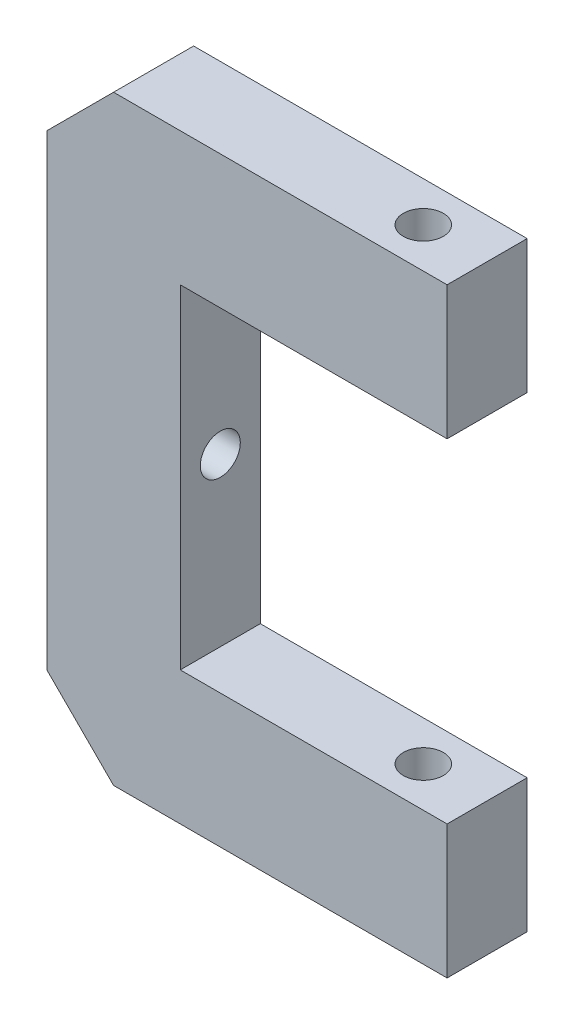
ISO-10303-21;
HEADER;
FILE_DESCRIPTION(('STEP AP214'),'2;1');
FILE_NAME('part.step','',(''),(''),'','','');
FILE_SCHEMA(('AUTOMOTIVE_DESIGN { 1 0 10303 214 1 1 1 1 }'));
ENDSEC;
DATA;
#1=APPLICATION_CONTEXT('core data for automotive mechanical design processes');
#2=APPLICATION_PROTOCOL_DEFINITION('international standard','automotive_design',2000,#1);
#3=PRODUCT_CONTEXT('',#1,'mechanical');
#4=PRODUCT('Part','Part','',(#3));
#5=PRODUCT_RELATED_PRODUCT_CATEGORY('part','',(#4));
#6=PRODUCT_DEFINITION_FORMATION('','',#4);
#7=PRODUCT_DEFINITION_CONTEXT('part definition',#1,'design');
#8=PRODUCT_DEFINITION('design','',#6,#7);
#9=PRODUCT_DEFINITION_SHAPE('','',#8);
#10=(LENGTH_UNIT() NAMED_UNIT(*) SI_UNIT(.MILLI.,.METRE.));
#11=(NAMED_UNIT(*) PLANE_ANGLE_UNIT() SI_UNIT($,.RADIAN.));
#12=(NAMED_UNIT(*) SI_UNIT($,.STERADIAN.) SOLID_ANGLE_UNIT());
#13=UNCERTAINTY_MEASURE_WITH_UNIT(LENGTH_MEASURE(1.E-05),#10,'distance_accuracy_value','');
#14=(GEOMETRIC_REPRESENTATION_CONTEXT(3) GLOBAL_UNCERTAINTY_ASSIGNED_CONTEXT((#13)) GLOBAL_UNIT_ASSIGNED_CONTEXT((#10,
#11,#12)) REPRESENTATION_CONTEXT('',''));
#15=CARTESIAN_POINT('',(0.,0.,0.));
#16=DIRECTION('',(0.,0.,1.));
#17=DIRECTION('',(1.,0.,0.));
#18=AXIS2_PLACEMENT_3D('',#15,#16,#17);
#19=CARTESIAN_POINT('',(0.,45.,6.));
#20=DIRECTION('',(1.,0.,0.));
#21=DIRECTION('',(0.,1.,0.));
#22=AXIS2_PLACEMENT_3D('',#19,#20,#21);
#23=PLANE('',#22);
#24=CARTESIAN_POINT('',(0.,22.5,3.));
#25=DIRECTION('',(-1.,0.,0.));
#26=DIRECTION('',(0.,-1.,0.));
#27=AXIS2_PLACEMENT_3D('',#24,#25,#26);
#28=CIRCLE('',#27,1.5);
#29=CARTESIAN_POINT('',(0.,21.,3.));
#30=VERTEX_POINT('',#29);
#31=EDGE_CURVE('E182',#30,#30,#28,.T.);
#32=ORIENTED_EDGE('',*,*,#31,.F.);
#33=EDGE_LOOP('',(#32));
#34=FACE_BOUND('',#33,.T.);
#35=DIRECTION('',(0.,-1.,0.));
#36=VECTOR('',#35,1.);
#37=CARTESIAN_POINT('',(0.,45.,0.));
#38=LINE('',#37,#36);
#39=CARTESIAN_POINT('',(0.,40.,0.));
#40=VERTEX_POINT('',#39);
#41=CARTESIAN_POINT('',(0.,5.00000000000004,0.));
#42=VERTEX_POINT('',#41);
#43=EDGE_CURVE('E150',#40,#42,#38,.T.);
#44=ORIENTED_EDGE('',*,*,#43,.T.);
#45=DIRECTION('',(0.,0.,1.));
#46=VECTOR('',#45,1.);
#47=CARTESIAN_POINT('',(0.,5.00000000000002,6.));
#48=LINE('',#47,#46);
#49=CARTESIAN_POINT('',(0.,5.00000000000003,6.));
#50=VERTEX_POINT('',#49);
#51=EDGE_CURVE('E54',#42,#50,#48,.T.);
#52=ORIENTED_EDGE('',*,*,#51,.T.);
#53=DIRECTION('',(0.,-1.,0.));
#54=VECTOR('',#53,1.);
#55=CARTESIAN_POINT('',(0.,45.,6.));
#56=LINE('',#55,#54);
#57=CARTESIAN_POINT('',(0.,40.,6.));
#58=VERTEX_POINT('',#57);
#59=EDGE_CURVE('E121',#58,#50,#56,.T.);
#60=ORIENTED_EDGE('',*,*,#59,.F.);
#61=DIRECTION('',(0.,0.,-1.));
#62=VECTOR('',#61,1.);
#63=CARTESIAN_POINT('',(0.,40.,6.));
#64=LINE('',#63,#62);
#65=EDGE_CURVE('E188',#58,#40,#64,.T.);
#66=ORIENTED_EDGE('',*,*,#65,.T.);
#67=EDGE_LOOP('',(#44,#52,#60,#66));
#68=FACE_BOUND('',#67,.T.);
#69=ADVANCED_FACE('F33',(#34,#68),#23,.F.);
#70=CARTESIAN_POINT('',(0.,0.,6.));
#71=DIRECTION('',(0.,1.,0.));
#72=DIRECTION('',(0.,0.,1.));
#73=AXIS2_PLACEMENT_3D('',#70,#71,#72);
#74=PLANE('',#73);
#75=CARTESIAN_POINT('',(25.2169782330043,0.,3.));
#76=DIRECTION('',(0.,1.,0.));
#77=DIRECTION('',(-1.,0.,0.));
#78=AXIS2_PLACEMENT_3D('',#75,#76,#77);
#79=CIRCLE('',#78,1.5);
#80=CARTESIAN_POINT('',(23.7169782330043,0.,3.));
#81=VERTEX_POINT('',#80);
#82=EDGE_CURVE('E271',#81,#81,#79,.T.);
#83=ORIENTED_EDGE('',*,*,#82,.T.);
#84=EDGE_LOOP('',(#83));
#85=FACE_BOUND('',#84,.T.);
#86=DIRECTION('',(1.,0.,0.));
#87=VECTOR('',#86,1.);
#88=CARTESIAN_POINT('',(0.,0.,6.));
#89=LINE('',#88,#87);
#90=CARTESIAN_POINT('',(5.,0.,6.));
#91=VERTEX_POINT('',#90);
#92=CARTESIAN_POINT('',(30.,0.,6.));
#93=VERTEX_POINT('',#92);
#94=EDGE_CURVE('E111',#91,#93,#89,.T.);
#95=ORIENTED_EDGE('',*,*,#94,.F.);
#96=DIRECTION('',(0.,0.,-1.));
#97=VECTOR('',#96,1.);
#98=CARTESIAN_POINT('',(5.,0.,6.));
#99=LINE('',#98,#97);
#100=CARTESIAN_POINT('',(5.,0.,0.));
#101=VERTEX_POINT('',#100);
#102=EDGE_CURVE('E130',#91,#101,#99,.T.);
#103=ORIENTED_EDGE('',*,*,#102,.T.);
#104=DIRECTION('',(1.,0.,0.));
#105=VECTOR('',#104,1.);
#106=CARTESIAN_POINT('',(0.,0.,0.));
#107=LINE('',#106,#105);
#108=CARTESIAN_POINT('',(30.,0.,0.));
#109=VERTEX_POINT('',#108);
#110=EDGE_CURVE('E127',#101,#109,#107,.T.);
#111=ORIENTED_EDGE('',*,*,#110,.T.);
#112=DIRECTION('',(0.,0.,-1.));
#113=VECTOR('',#112,1.);
#114=CARTESIAN_POINT('',(30.,0.,6.));
#115=LINE('',#114,#113);
#116=EDGE_CURVE('E124',#93,#109,#115,.T.);
#117=ORIENTED_EDGE('',*,*,#116,.F.);
#118=EDGE_LOOP('',(#95,#103,#111,#117));
#119=FACE_BOUND('',#118,.T.);
#120=ADVANCED_FACE('F125',(#85,#119),#74,.F.);
#121=CARTESIAN_POINT('',(30.,0.,6.));
#122=DIRECTION('',(-1.,0.,0.));
#123=DIRECTION('',(0.,0.,1.));
#124=AXIS2_PLACEMENT_3D('',#121,#122,#123);
#125=PLANE('',#124);
#126=DIRECTION('',(0.,1.,0.));
#127=VECTOR('',#126,1.);
#128=CARTESIAN_POINT('',(30.,0.,0.));
#129=LINE('',#128,#127);
#130=CARTESIAN_POINT('',(30.,10.,0.));
#131=VERTEX_POINT('',#130);
#132=EDGE_CURVE('E154',#109,#131,#129,.T.);
#133=ORIENTED_EDGE('',*,*,#132,.T.);
#134=DIRECTION('',(0.,0.,-1.));
#135=VECTOR('',#134,1.);
#136=CARTESIAN_POINT('',(30.,10.,6.));
#137=LINE('',#136,#135);
#138=CARTESIAN_POINT('',(30.,10.,6.));
#139=VERTEX_POINT('',#138);
#140=EDGE_CURVE('E131',#139,#131,#137,.T.);
#141=ORIENTED_EDGE('',*,*,#140,.F.);
#142=DIRECTION('',(0.,1.,0.));
#143=VECTOR('',#142,1.);
#144=CARTESIAN_POINT('',(30.,0.,6.));
#145=LINE('',#144,#143);
#146=EDGE_CURVE('E115',#93,#139,#145,.T.);
#147=ORIENTED_EDGE('',*,*,#146,.F.);
#148=ORIENTED_EDGE('',*,*,#116,.T.);
#149=EDGE_LOOP('',(#133,#141,#147,#148));
#150=FACE_BOUND('',#149,.T.);
#151=ADVANCED_FACE('F133',(#150),#125,.F.);
#152=CARTESIAN_POINT('',(30.,10.,6.));
#153=DIRECTION('',(0.,-1.,0.));
#154=DIRECTION('',(1.,0.,0.));
#155=AXIS2_PLACEMENT_3D('',#152,#153,#154);
#156=PLANE('',#155);
#157=CARTESIAN_POINT('',(25.2169782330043,10.,3.));
#158=DIRECTION('',(0.,-1.,0.));
#159=DIRECTION('',(1.,0.,0.));
#160=AXIS2_PLACEMENT_3D('',#157,#158,#159);
#161=CIRCLE('',#160,1.5);
#162=CARTESIAN_POINT('',(23.7169782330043,10.,3.));
#163=VERTEX_POINT('',#162);
#164=EDGE_CURVE('E152',#163,#163,#161,.T.);
#165=ORIENTED_EDGE('',*,*,#164,.T.);
#166=EDGE_LOOP('',(#165));
#167=FACE_BOUND('',#166,.T.);
#168=DIRECTION('',(-1.,0.,0.));
#169=VECTOR('',#168,1.);
#170=CARTESIAN_POINT('',(30.,10.,0.));
#171=LINE('',#170,#169);
#172=CARTESIAN_POINT('',(10.,10.,0.));
#173=VERTEX_POINT('',#172);
#174=EDGE_CURVE('E156',#131,#173,#171,.T.);
#175=ORIENTED_EDGE('',*,*,#174,.T.);
#176=DIRECTION('',(0.,0.,-1.));
#177=VECTOR('',#176,1.);
#178=CARTESIAN_POINT('',(10.,10.,6.));
#179=LINE('',#178,#177);
#180=CARTESIAN_POINT('',(10.,10.,6.));
#181=VERTEX_POINT('',#180);
#182=EDGE_CURVE('E174',#181,#173,#179,.T.);
#183=ORIENTED_EDGE('',*,*,#182,.F.);
#184=DIRECTION('',(-1.,0.,0.));
#185=VECTOR('',#184,1.);
#186=CARTESIAN_POINT('',(30.,10.,6.));
#187=LINE('',#186,#185);
#188=EDGE_CURVE('E136',#139,#181,#187,.T.);
#189=ORIENTED_EDGE('',*,*,#188,.F.);
#190=ORIENTED_EDGE('',*,*,#140,.T.);
#191=EDGE_LOOP('',(#175,#183,#189,#190));
#192=FACE_BOUND('',#191,.T.);
#193=ADVANCED_FACE('F219',(#167,#192),#156,.F.);
#194=CARTESIAN_POINT('',(10.,10.,6.));
#195=DIRECTION('',(-1.,0.,0.));
#196=DIRECTION('',(0.,0.,1.));
#197=AXIS2_PLACEMENT_3D('',#194,#195,#196);
#198=PLANE('',#197);
#199=CARTESIAN_POINT('',(10.,22.5,3.));
#200=DIRECTION('',(-1.,0.,0.));
#201=DIRECTION('',(0.,0.,1.));
#202=AXIS2_PLACEMENT_3D('',#199,#200,#201);
#203=CIRCLE('',#202,1.5);
#204=CARTESIAN_POINT('',(10.,21.,3.));
#205=VERTEX_POINT('',#204);
#206=EDGE_CURVE('E178',#205,#205,#203,.T.);
#207=ORIENTED_EDGE('',*,*,#206,.T.);
#208=EDGE_LOOP('',(#207));
#209=FACE_BOUND('',#208,.T.);
#210=DIRECTION('',(0.,1.,0.));
#211=VECTOR('',#210,1.);
#212=CARTESIAN_POINT('',(10.,10.,0.));
#213=LINE('',#212,#211);
#214=CARTESIAN_POINT('',(10.,35.,0.));
#215=VERTEX_POINT('',#214);
#216=EDGE_CURVE('E158',#173,#215,#213,.T.);
#217=ORIENTED_EDGE('',*,*,#216,.T.);
#218=DIRECTION('',(0.,0.,-1.));
#219=VECTOR('',#218,1.);
#220=CARTESIAN_POINT('',(10.,35.,6.));
#221=LINE('',#220,#219);
#222=CARTESIAN_POINT('',(10.,35.,6.));
#223=VERTEX_POINT('',#222);
#224=EDGE_CURVE('E171',#223,#215,#221,.T.);
#225=ORIENTED_EDGE('',*,*,#224,.F.);
#226=DIRECTION('',(0.,1.,0.));
#227=VECTOR('',#226,1.);
#228=CARTESIAN_POINT('',(10.,10.,6.));
#229=LINE('',#228,#227);
#230=EDGE_CURVE('E138',#181,#223,#229,.T.);
#231=ORIENTED_EDGE('',*,*,#230,.F.);
#232=ORIENTED_EDGE('',*,*,#182,.T.);
#233=EDGE_LOOP('',(#217,#225,#231,#232));
#234=FACE_BOUND('',#233,.T.);
#235=ADVANCED_FACE('F216',(#209,#234),#198,.F.);
#236=CARTESIAN_POINT('',(10.,35.,6.));
#237=DIRECTION('',(0.,1.,0.));
#238=DIRECTION('',(0.,0.,1.));
#239=AXIS2_PLACEMENT_3D('',#236,#237,#238);
#240=PLANE('',#239);
#241=CARTESIAN_POINT('',(25.2169782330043,35.,3.));
#242=DIRECTION('',(0.,1.,0.));
#243=DIRECTION('',(0.,0.,1.));
#244=AXIS2_PLACEMENT_3D('',#241,#242,#243);
#245=CIRCLE('',#244,1.5);
#246=CARTESIAN_POINT('',(23.7169782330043,35.,3.));
#247=VERTEX_POINT('',#246);
#248=EDGE_CURVE('E274',#247,#247,#245,.T.);
#249=ORIENTED_EDGE('',*,*,#248,.T.);
#250=EDGE_LOOP('',(#249));
#251=FACE_BOUND('',#250,.T.);
#252=DIRECTION('',(1.,0.,0.));
#253=VECTOR('',#252,1.);
#254=CARTESIAN_POINT('',(10.,35.,0.));
#255=LINE('',#254,#253);
#256=CARTESIAN_POINT('',(30.,35.,0.));
#257=VERTEX_POINT('',#256);
#258=EDGE_CURVE('E160',#215,#257,#255,.T.);
#259=ORIENTED_EDGE('',*,*,#258,.T.);
#260=DIRECTION('',(0.,0.,-1.));
#261=VECTOR('',#260,1.);
#262=CARTESIAN_POINT('',(30.,35.,6.));
#263=LINE('',#262,#261);
#264=CARTESIAN_POINT('',(30.,35.,6.));
#265=VERTEX_POINT('',#264);
#266=EDGE_CURVE('E168',#265,#257,#263,.T.);
#267=ORIENTED_EDGE('',*,*,#266,.F.);
#268=DIRECTION('',(1.,0.,0.));
#269=VECTOR('',#268,1.);
#270=CARTESIAN_POINT('',(10.,35.,6.));
#271=LINE('',#270,#269);
#272=EDGE_CURVE('E143',#223,#265,#271,.T.);
#273=ORIENTED_EDGE('',*,*,#272,.F.);
#274=ORIENTED_EDGE('',*,*,#224,.T.);
#275=EDGE_LOOP('',(#259,#267,#273,#274));
#276=FACE_BOUND('',#275,.T.);
#277=ADVANCED_FACE('F211',(#251,#276),#240,.F.);
#278=CARTESIAN_POINT('',(30.,35.,6.));
#279=DIRECTION('',(-1.,0.,0.));
#280=DIRECTION('',(0.,0.,1.));
#281=AXIS2_PLACEMENT_3D('',#278,#279,#280);
#282=PLANE('',#281);
#283=DIRECTION('',(0.,1.,0.));
#284=VECTOR('',#283,1.);
#285=CARTESIAN_POINT('',(30.,35.,0.));
#286=LINE('',#285,#284);
#287=CARTESIAN_POINT('',(30.,45.,0.));
#288=VERTEX_POINT('',#287);
#289=EDGE_CURVE('E162',#257,#288,#286,.T.);
#290=ORIENTED_EDGE('',*,*,#289,.T.);
#291=DIRECTION('',(0.,0.,-1.));
#292=VECTOR('',#291,1.);
#293=CARTESIAN_POINT('',(30.,45.,6.));
#294=LINE('',#293,#292);
#295=CARTESIAN_POINT('',(30.,45.,6.));
#296=VERTEX_POINT('',#295);
#297=EDGE_CURVE('E149',#296,#288,#294,.T.);
#298=ORIENTED_EDGE('',*,*,#297,.F.);
#299=DIRECTION('',(0.,1.,0.));
#300=VECTOR('',#299,1.);
#301=CARTESIAN_POINT('',(30.,35.,6.));
#302=LINE('',#301,#300);
#303=EDGE_CURVE('E145',#265,#296,#302,.T.);
#304=ORIENTED_EDGE('',*,*,#303,.F.);
#305=ORIENTED_EDGE('',*,*,#266,.T.);
#306=EDGE_LOOP('',(#290,#298,#304,#305));
#307=FACE_BOUND('',#306,.T.);
#308=ADVANCED_FACE('F205',(#307),#282,.F.);
#309=CARTESIAN_POINT('',(30.,45.,6.));
#310=DIRECTION('',(0.,-1.,0.));
#311=DIRECTION('',(1.,0.,0.));
#312=AXIS2_PLACEMENT_3D('',#309,#310,#311);
#313=PLANE('',#312);
#314=CARTESIAN_POINT('',(25.2169782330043,45.,3.));
#315=DIRECTION('',(0.,1.,0.));
#316=DIRECTION('',(-1.,0.,0.));
#317=AXIS2_PLACEMENT_3D('',#314,#315,#316);
#318=CIRCLE('',#317,1.5);
#319=CARTESIAN_POINT('',(23.7169782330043,45.,3.));
#320=VERTEX_POINT('',#319);
#321=EDGE_CURVE('E181',#320,#320,#318,.T.);
#322=ORIENTED_EDGE('',*,*,#321,.F.);
#323=EDGE_LOOP('',(#322));
#324=FACE_BOUND('',#323,.T.);
#325=DIRECTION('',(-1.,0.,0.));
#326=VECTOR('',#325,1.);
#327=CARTESIAN_POINT('',(30.,45.,0.));
#328=LINE('',#327,#326);
#329=CARTESIAN_POINT('',(5.00000000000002,45.,0.));
#330=VERTEX_POINT('',#329);
#331=EDGE_CURVE('E164',#288,#330,#328,.T.);
#332=ORIENTED_EDGE('',*,*,#331,.T.);
#333=DIRECTION('',(0.,0.,1.));
#334=VECTOR('',#333,1.);
#335=CARTESIAN_POINT('',(5.00000000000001,45.,6.));
#336=LINE('',#335,#334);
#337=CARTESIAN_POINT('',(5.00000000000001,45.,6.));
#338=VERTEX_POINT('',#337);
#339=EDGE_CURVE('E11',#330,#338,#336,.T.);
#340=ORIENTED_EDGE('',*,*,#339,.T.);
#341=DIRECTION('',(-1.,0.,0.));
#342=VECTOR('',#341,1.);
#343=CARTESIAN_POINT('',(30.,45.,6.));
#344=LINE('',#343,#342);
#345=EDGE_CURVE('E147',#296,#338,#344,.T.);
#346=ORIENTED_EDGE('',*,*,#345,.F.);
#347=ORIENTED_EDGE('',*,*,#297,.T.);
#348=EDGE_LOOP('',(#332,#340,#346,#347));
#349=FACE_BOUND('',#348,.T.);
#350=ADVANCED_FACE('F201',(#324,#349),#313,.F.);
#351=CARTESIAN_POINT('',(0.,0.,6.));
#352=DIRECTION('',(0.,0.,1.));
#353=DIRECTION('',(1.,0.,0.));
#354=AXIS2_PLACEMENT_3D('',#351,#352,#353);
#355=PLANE('',#354);
#356=ORIENTED_EDGE('',*,*,#59,.T.);
#357=DIRECTION('',(-0.707106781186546,0.707106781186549,0.));
#358=VECTOR('',#357,1.);
#359=CARTESIAN_POINT('',(2.50000000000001,2.5,6.));
#360=LINE('',#359,#358);
#361=EDGE_CURVE('E41',#50,#91,#360,.F.);
#362=ORIENTED_EDGE('',*,*,#361,.T.);
#363=ORIENTED_EDGE('',*,*,#94,.T.);
#364=ORIENTED_EDGE('',*,*,#146,.T.);
#365=ORIENTED_EDGE('',*,*,#188,.T.);
#366=ORIENTED_EDGE('',*,*,#230,.T.);
#367=ORIENTED_EDGE('',*,*,#272,.T.);
#368=ORIENTED_EDGE('',*,*,#303,.T.);
#369=ORIENTED_EDGE('',*,*,#345,.T.);
#370=DIRECTION('',(0.707106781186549,0.707106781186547,0.));
#371=VECTOR('',#370,1.);
#372=CARTESIAN_POINT('',(-20.,20.0000000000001,6.));
#373=LINE('',#372,#371);
#374=EDGE_CURVE('E192',#338,#58,#373,.F.);
#375=ORIENTED_EDGE('',*,*,#374,.T.);
#376=EDGE_LOOP('',(#356,#362,#363,#364,#365,#366,#367,#368,#369,#375));
#377=FACE_BOUND('',#376,.T.);
#378=ADVANCED_FACE('F113',(#377),#355,.T.);
#379=CARTESIAN_POINT('',(0.,0.,0.));
#380=DIRECTION('',(0.,0.,1.));
#381=DIRECTION('',(1.,0.,0.));
#382=AXIS2_PLACEMENT_3D('',#379,#380,#381);
#383=PLANE('',#382);
#384=ORIENTED_EDGE('',*,*,#110,.F.);
#385=DIRECTION('',(0.707106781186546,-0.707106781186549,0.));
#386=VECTOR('',#385,1.);
#387=CARTESIAN_POINT('',(5.,0.,0.));
#388=LINE('',#387,#386);
#389=EDGE_CURVE('E186',#101,#42,#388,.F.);
#390=ORIENTED_EDGE('',*,*,#389,.T.);
#391=ORIENTED_EDGE('',*,*,#43,.F.);
#392=DIRECTION('',(-0.707106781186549,-0.707106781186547,0.));
#393=VECTOR('',#392,1.);
#394=CARTESIAN_POINT('',(0.,40.,0.));
#395=LINE('',#394,#393);
#396=EDGE_CURVE('E184',#40,#330,#395,.F.);
#397=ORIENTED_EDGE('',*,*,#396,.T.);
#398=ORIENTED_EDGE('',*,*,#331,.F.);
#399=ORIENTED_EDGE('',*,*,#289,.F.);
#400=ORIENTED_EDGE('',*,*,#258,.F.);
#401=ORIENTED_EDGE('',*,*,#216,.F.);
#402=ORIENTED_EDGE('',*,*,#174,.F.);
#403=ORIENTED_EDGE('',*,*,#132,.F.);
#404=EDGE_LOOP('',(#384,#390,#391,#397,#398,#399,#400,#401,#402,#403));
#405=FACE_BOUND('',#404,.T.);
#406=ADVANCED_FACE('F199',(#405),#383,.F.);
#407=CARTESIAN_POINT('',(25.2169782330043,0.,3.));
#408=DIRECTION('',(0.,1.,0.));
#409=DIRECTION('',(-1.,0.,0.));
#410=AXIS2_PLACEMENT_3D('',#407,#408,#409);
#411=CYLINDRICAL_SURFACE('',#410,1.5);
#412=CARTESIAN_POINT('',(23.7169782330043,45.,3.));
#413=CARTESIAN_POINT('',(23.7169782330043,44.8958333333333,3.));
#414=CARTESIAN_POINT('',(23.7169782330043,44.7916666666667,3.));
#415=CARTESIAN_POINT('',(23.7169782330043,44.5833333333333,3.));
#416=CARTESIAN_POINT('',(23.7169782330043,44.4791666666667,3.));
#417=CARTESIAN_POINT('',(23.7169782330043,44.2708333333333,3.));
#418=CARTESIAN_POINT('',(23.7169782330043,44.1666666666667,3.));
#419=CARTESIAN_POINT('',(23.7169782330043,43.9583333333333,3.));
#420=CARTESIAN_POINT('',(23.7169782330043,43.8541666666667,3.));
#421=CARTESIAN_POINT('',(23.7169782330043,43.6458333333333,3.));
#422=CARTESIAN_POINT('',(23.7169782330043,43.5416666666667,3.));
#423=CARTESIAN_POINT('',(23.7169782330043,43.3333333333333,3.));
#424=CARTESIAN_POINT('',(23.7169782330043,43.2291666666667,3.));
#425=CARTESIAN_POINT('',(23.7169782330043,43.0208333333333,3.));
#426=CARTESIAN_POINT('',(23.7169782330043,42.9166666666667,3.));
#427=CARTESIAN_POINT('',(23.7169782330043,42.7083333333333,3.));
#428=CARTESIAN_POINT('',(23.7169782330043,42.6041666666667,3.));
#429=CARTESIAN_POINT('',(23.7169782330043,42.3958333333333,3.));
#430=CARTESIAN_POINT('',(23.7169782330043,42.2916666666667,3.));
#431=CARTESIAN_POINT('',(23.7169782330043,42.0833333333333,3.));
#432=CARTESIAN_POINT('',(23.7169782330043,41.9791666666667,3.));
#433=CARTESIAN_POINT('',(23.7169782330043,41.7708333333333,3.));
#434=CARTESIAN_POINT('',(23.7169782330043,41.6666666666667,3.));
#435=CARTESIAN_POINT('',(23.7169782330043,41.4583333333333,3.));
#436=CARTESIAN_POINT('',(23.7169782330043,41.3541666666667,3.));
#437=CARTESIAN_POINT('',(23.7169782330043,41.1458333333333,3.));
#438=CARTESIAN_POINT('',(23.7169782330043,41.0416666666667,3.));
#439=CARTESIAN_POINT('',(23.7169782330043,40.8333333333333,3.));
#440=CARTESIAN_POINT('',(23.7169782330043,40.7291666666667,3.));
#441=CARTESIAN_POINT('',(23.7169782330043,40.5208333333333,3.));
#442=CARTESIAN_POINT('',(23.7169782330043,40.4166666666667,3.));
#443=CARTESIAN_POINT('',(23.7169782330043,40.2083333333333,3.));
#444=CARTESIAN_POINT('',(23.7169782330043,40.1041666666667,3.));
#445=CARTESIAN_POINT('',(23.7169782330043,39.8958333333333,3.));
#446=CARTESIAN_POINT('',(23.7169782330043,39.7916666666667,3.));
#447=CARTESIAN_POINT('',(23.7169782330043,39.5833333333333,3.));
#448=CARTESIAN_POINT('',(23.7169782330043,39.4791666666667,3.));
#449=CARTESIAN_POINT('',(23.7169782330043,39.2708333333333,3.));
#450=CARTESIAN_POINT('',(23.7169782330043,39.1666666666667,3.));
#451=CARTESIAN_POINT('',(23.7169782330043,38.9583333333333,3.));
#452=CARTESIAN_POINT('',(23.7169782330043,38.8541666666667,3.));
#453=CARTESIAN_POINT('',(23.7169782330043,38.6458333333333,3.));
#454=CARTESIAN_POINT('',(23.7169782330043,38.5416666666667,3.));
#455=CARTESIAN_POINT('',(23.7169782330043,38.3333333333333,3.));
#456=CARTESIAN_POINT('',(23.7169782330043,38.2291666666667,3.));
#457=CARTESIAN_POINT('',(23.7169782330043,38.0208333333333,3.));
#458=CARTESIAN_POINT('',(23.7169782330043,37.9166666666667,3.));
#459=CARTESIAN_POINT('',(23.7169782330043,37.7083333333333,3.));
#460=CARTESIAN_POINT('',(23.7169782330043,37.6041666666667,3.));
#461=CARTESIAN_POINT('',(23.7169782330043,37.3958333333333,3.));
#462=CARTESIAN_POINT('',(23.7169782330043,37.2916666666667,3.));
#463=CARTESIAN_POINT('',(23.7169782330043,37.0833333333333,3.));
#464=CARTESIAN_POINT('',(23.7169782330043,36.9791666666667,3.));
#465=CARTESIAN_POINT('',(23.7169782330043,36.7708333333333,3.));
#466=CARTESIAN_POINT('',(23.7169782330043,36.6666666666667,3.));
#467=CARTESIAN_POINT('',(23.7169782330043,36.4583333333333,3.));
#468=CARTESIAN_POINT('',(23.7169782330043,36.3541666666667,3.));
#469=CARTESIAN_POINT('',(23.7169782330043,36.1458333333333,3.));
#470=CARTESIAN_POINT('',(23.7169782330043,36.0416666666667,3.));
#471=CARTESIAN_POINT('',(23.7169782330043,35.8333333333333,3.));
#472=CARTESIAN_POINT('',(23.7169782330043,35.7291666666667,3.));
#473=CARTESIAN_POINT('',(23.7169782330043,35.5208333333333,3.));
#474=CARTESIAN_POINT('',(23.7169782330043,35.4166666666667,3.));
#475=CARTESIAN_POINT('',(23.7169782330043,35.2083333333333,3.));
#476=CARTESIAN_POINT('',(23.7169782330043,35.1041666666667,3.));
#477=CARTESIAN_POINT('',(23.7169782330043,35.,3.));
#478=B_SPLINE_CURVE_WITH_KNOTS('',3,(#412,#413,#414,#415,#416,#417,#418,#419,#420,#421,#422,
#423,#424,#425,#426,#427,#428,#429,#430,#431,#432,#433,#434,#435,#436,#437,#438,#439,#440,#441,
#442,#443,#444,#445,#446,#447,#448,#449,#450,#451,#452,#453,#454,#455,#456,#457,#458,#459,#460,
#461,#462,#463,#464,#465,#466,#467,#468,#469,#470,#471,#472,#473,#474,#475,#476,#477),
.UNSPECIFIED.,.F.,.F.,(4,2,2,2,2,2,2,2,2,2,2,2,2,2,2,2,2,2,2,2,2,2,2,2,2,2,2,2,2,2,2,2,4),(0.,
0.3125,0.625000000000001,0.937500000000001,1.25,1.5625,1.875,2.1875,2.5,2.8125,3.125,3.4375,
3.75,4.0625,4.375,4.6875,5.,5.3125,5.62500000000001,5.93750000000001,6.25000000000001,
6.56250000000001,6.87500000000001,7.18750000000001,7.50000000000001,7.81250000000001,
8.12500000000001,8.43750000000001,8.75000000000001,9.06250000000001,9.37500000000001,
9.68750000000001,10.),.UNSPECIFIED.);
#479=EDGE_CURVE('BSEAM259',#320,#247,#478,.T.);
#480=ORIENTED_EDGE('',*,*,#321,.T.);
#481=ORIENTED_EDGE('',*,*,#248,.F.);
#482=ORIENTED_EDGE('',*,*,#479,.T.);
#483=ORIENTED_EDGE('',*,*,#479,.F.);
#484=EDGE_LOOP('',(#480,#482,#481,#483));
#485=FACE_BOUND('',#484,.T.);
#486=ADVANCED_FACE('F259',(#485),#411,.F.);
#487=CARTESIAN_POINT('',(23.7169782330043,0.,3.));
#488=CARTESIAN_POINT('',(23.7169782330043,0.104166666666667,3.));
#489=CARTESIAN_POINT('',(23.7169782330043,0.208333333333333,3.));
#490=CARTESIAN_POINT('',(23.7169782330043,0.416666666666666,3.));
#491=CARTESIAN_POINT('',(23.7169782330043,0.520833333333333,3.));
#492=CARTESIAN_POINT('',(23.7169782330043,0.729166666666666,3.));
#493=CARTESIAN_POINT('',(23.7169782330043,0.833333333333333,3.));
#494=CARTESIAN_POINT('',(23.7169782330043,1.04166666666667,3.));
#495=CARTESIAN_POINT('',(23.7169782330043,1.14583333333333,3.));
#496=CARTESIAN_POINT('',(23.7169782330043,1.35416666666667,3.));
#497=CARTESIAN_POINT('',(23.7169782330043,1.45833333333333,3.));
#498=CARTESIAN_POINT('',(23.7169782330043,1.66666666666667,3.));
#499=CARTESIAN_POINT('',(23.7169782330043,1.77083333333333,3.));
#500=CARTESIAN_POINT('',(23.7169782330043,1.97916666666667,3.));
#501=CARTESIAN_POINT('',(23.7169782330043,2.08333333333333,3.));
#502=CARTESIAN_POINT('',(23.7169782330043,2.29166666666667,3.));
#503=CARTESIAN_POINT('',(23.7169782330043,2.39583333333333,3.));
#504=CARTESIAN_POINT('',(23.7169782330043,2.60416666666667,3.));
#505=CARTESIAN_POINT('',(23.7169782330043,2.70833333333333,3.));
#506=CARTESIAN_POINT('',(23.7169782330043,2.91666666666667,3.));
#507=CARTESIAN_POINT('',(23.7169782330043,3.02083333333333,3.));
#508=CARTESIAN_POINT('',(23.7169782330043,3.22916666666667,3.));
#509=CARTESIAN_POINT('',(23.7169782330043,3.33333333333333,3.));
#510=CARTESIAN_POINT('',(23.7169782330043,3.54166666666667,3.));
#511=CARTESIAN_POINT('',(23.7169782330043,3.64583333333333,3.));
#512=CARTESIAN_POINT('',(23.7169782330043,3.85416666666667,3.));
#513=CARTESIAN_POINT('',(23.7169782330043,3.95833333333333,3.));
#514=CARTESIAN_POINT('',(23.7169782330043,4.16666666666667,3.));
#515=CARTESIAN_POINT('',(23.7169782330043,4.27083333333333,3.));
#516=CARTESIAN_POINT('',(23.7169782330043,4.47916666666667,3.));
#517=CARTESIAN_POINT('',(23.7169782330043,4.58333333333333,3.));
#518=CARTESIAN_POINT('',(23.7169782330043,4.79166666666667,3.));
#519=CARTESIAN_POINT('',(23.7169782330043,4.89583333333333,3.));
#520=CARTESIAN_POINT('',(23.7169782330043,5.10416666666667,3.));
#521=CARTESIAN_POINT('',(23.7169782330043,5.20833333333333,3.));
#522=CARTESIAN_POINT('',(23.7169782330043,5.41666666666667,3.));
#523=CARTESIAN_POINT('',(23.7169782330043,5.52083333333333,3.));
#524=CARTESIAN_POINT('',(23.7169782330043,5.72916666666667,3.));
#525=CARTESIAN_POINT('',(23.7169782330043,5.83333333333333,3.));
#526=CARTESIAN_POINT('',(23.7169782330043,6.04166666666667,3.));
#527=CARTESIAN_POINT('',(23.7169782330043,6.14583333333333,3.));
#528=CARTESIAN_POINT('',(23.7169782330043,6.35416666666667,3.));
#529=CARTESIAN_POINT('',(23.7169782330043,6.45833333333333,3.));
#530=CARTESIAN_POINT('',(23.7169782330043,6.66666666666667,3.));
#531=CARTESIAN_POINT('',(23.7169782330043,6.77083333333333,3.));
#532=CARTESIAN_POINT('',(23.7169782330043,6.97916666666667,3.));
#533=CARTESIAN_POINT('',(23.7169782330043,7.08333333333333,3.));
#534=CARTESIAN_POINT('',(23.7169782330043,7.29166666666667,3.));
#535=CARTESIAN_POINT('',(23.7169782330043,7.39583333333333,3.));
#536=CARTESIAN_POINT('',(23.7169782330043,7.60416666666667,3.));
#537=CARTESIAN_POINT('',(23.7169782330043,7.70833333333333,3.));
#538=CARTESIAN_POINT('',(23.7169782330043,7.91666666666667,3.));
#539=CARTESIAN_POINT('',(23.7169782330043,8.02083333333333,3.));
#540=CARTESIAN_POINT('',(23.7169782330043,8.22916666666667,3.));
#541=CARTESIAN_POINT('',(23.7169782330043,8.33333333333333,3.));
#542=CARTESIAN_POINT('',(23.7169782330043,8.54166666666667,3.));
#543=CARTESIAN_POINT('',(23.7169782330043,8.64583333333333,3.));
#544=CARTESIAN_POINT('',(23.7169782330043,8.85416666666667,3.));
#545=CARTESIAN_POINT('',(23.7169782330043,8.95833333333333,3.));
#546=CARTESIAN_POINT('',(23.7169782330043,9.16666666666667,3.));
#547=CARTESIAN_POINT('',(23.7169782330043,9.27083333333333,3.));
#548=CARTESIAN_POINT('',(23.7169782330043,9.47916666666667,3.));
#549=CARTESIAN_POINT('',(23.7169782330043,9.58333333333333,3.));
#550=CARTESIAN_POINT('',(23.7169782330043,9.79166666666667,3.));
#551=CARTESIAN_POINT('',(23.7169782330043,9.89583333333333,3.));
#552=CARTESIAN_POINT('',(23.7169782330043,10.,3.));
#553=B_SPLINE_CURVE_WITH_KNOTS('',3,(#487,#488,#489,#490,#491,#492,#493,#494,#495,#496,#497,
#498,#499,#500,#501,#502,#503,#504,#505,#506,#507,#508,#509,#510,#511,#512,#513,#514,#515,#516,
#517,#518,#519,#520,#521,#522,#523,#524,#525,#526,#527,#528,#529,#530,#531,#532,#533,#534,#535,
#536,#537,#538,#539,#540,#541,#542,#543,#544,#545,#546,#547,#548,#549,#550,#551,#552),
.UNSPECIFIED.,.F.,.F.,(4,2,2,2,2,2,2,2,2,2,2,2,2,2,2,2,2,2,2,2,2,2,2,2,2,2,2,2,2,2,2,2,4),(0.,
0.3125,0.625,0.9375,1.25,1.5625,1.875,2.1875,2.5,2.8125,3.125,3.4375,3.75,4.0625,4.375,4.6875,
5.,5.3125,5.625,5.9375,6.25,6.5625,6.875,7.1875,7.5,7.8125,8.125,8.4375,8.75,9.0625,9.375,
9.6875,10.),.UNSPECIFIED.);
#554=EDGE_CURVE('BSEAM228',#81,#163,#553,.T.);
#555=ORIENTED_EDGE('',*,*,#82,.F.);
#556=ORIENTED_EDGE('',*,*,#164,.F.);
#557=ORIENTED_EDGE('',*,*,#554,.T.);
#558=ORIENTED_EDGE('',*,*,#554,.F.);
#559=EDGE_LOOP('',(#555,#557,#556,#558));
#560=FACE_BOUND('',#559,.T.);
#561=ADVANCED_FACE('F228',(#560),#411,.F.);
#562=CARTESIAN_POINT('',(30.,22.5,3.));
#563=DIRECTION('',(-1.,0.,0.));
#564=DIRECTION('',(0.,-1.,0.));
#565=AXIS2_PLACEMENT_3D('',#562,#563,#564);
#566=CYLINDRICAL_SURFACE('',#565,1.5);
#567=CARTESIAN_POINT('',(0.,21.,3.));
#568=CARTESIAN_POINT('',(0.104166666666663,21.,3.));
#569=CARTESIAN_POINT('',(0.20833333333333,21.,3.));
#570=CARTESIAN_POINT('',(0.416666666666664,21.,3.));
#571=CARTESIAN_POINT('',(0.52083333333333,21.,3.));
#572=CARTESIAN_POINT('',(0.729166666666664,21.,3.));
#573=CARTESIAN_POINT('',(0.833333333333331,21.,3.));
#574=CARTESIAN_POINT('',(1.04166666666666,21.,3.));
#575=CARTESIAN_POINT('',(1.14583333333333,21.,3.));
#576=CARTESIAN_POINT('',(1.35416666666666,21.,3.));
#577=CARTESIAN_POINT('',(1.45833333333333,21.,3.));
#578=CARTESIAN_POINT('',(1.66666666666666,21.,3.));
#579=CARTESIAN_POINT('',(1.77083333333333,21.,3.));
#580=CARTESIAN_POINT('',(1.97916666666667,21.,3.));
#581=CARTESIAN_POINT('',(2.08333333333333,21.,3.));
#582=CARTESIAN_POINT('',(2.29166666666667,21.,3.));
#583=CARTESIAN_POINT('',(2.39583333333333,21.,3.));
#584=CARTESIAN_POINT('',(2.60416666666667,21.,3.));
#585=CARTESIAN_POINT('',(2.70833333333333,21.,3.));
#586=CARTESIAN_POINT('',(2.91666666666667,21.,3.));
#587=CARTESIAN_POINT('',(3.02083333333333,21.,3.));
#588=CARTESIAN_POINT('',(3.22916666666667,21.,3.));
#589=CARTESIAN_POINT('',(3.33333333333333,21.,3.));
#590=CARTESIAN_POINT('',(3.54166666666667,21.,3.));
#591=CARTESIAN_POINT('',(3.64583333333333,21.,3.));
#592=CARTESIAN_POINT('',(3.85416666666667,21.,3.));
#593=CARTESIAN_POINT('',(3.95833333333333,21.,3.));
#594=CARTESIAN_POINT('',(4.16666666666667,21.,3.));
#595=CARTESIAN_POINT('',(4.27083333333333,21.,3.));
#596=CARTESIAN_POINT('',(4.47916666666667,21.,3.));
#597=CARTESIAN_POINT('',(4.58333333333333,21.,3.));
#598=CARTESIAN_POINT('',(4.79166666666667,21.,3.));
#599=CARTESIAN_POINT('',(4.89583333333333,21.,3.));
#600=CARTESIAN_POINT('',(5.10416666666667,21.,3.));
#601=CARTESIAN_POINT('',(5.20833333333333,21.,3.));
#602=CARTESIAN_POINT('',(5.41666666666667,21.,3.));
#603=CARTESIAN_POINT('',(5.52083333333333,21.,3.));
#604=CARTESIAN_POINT('',(5.72916666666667,21.,3.));
#605=CARTESIAN_POINT('',(5.83333333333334,21.,3.));
#606=CARTESIAN_POINT('',(6.04166666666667,21.,3.));
#607=CARTESIAN_POINT('',(6.14583333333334,21.,3.));
#608=CARTESIAN_POINT('',(6.35416666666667,21.,3.));
#609=CARTESIAN_POINT('',(6.45833333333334,21.,3.));
#610=CARTESIAN_POINT('',(6.66666666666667,21.,3.));
#611=CARTESIAN_POINT('',(6.77083333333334,21.,3.));
#612=CARTESIAN_POINT('',(6.97916666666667,21.,3.));
#613=CARTESIAN_POINT('',(7.08333333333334,21.,3.));
#614=CARTESIAN_POINT('',(7.29166666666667,21.,3.));
#615=CARTESIAN_POINT('',(7.39583333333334,21.,3.));
#616=CARTESIAN_POINT('',(7.60416666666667,21.,3.));
#617=CARTESIAN_POINT('',(7.70833333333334,21.,3.));
#618=CARTESIAN_POINT('',(7.91666666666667,21.,3.));
#619=CARTESIAN_POINT('',(8.02083333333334,21.,3.));
#620=CARTESIAN_POINT('',(8.22916666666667,21.,3.));
#621=CARTESIAN_POINT('',(8.33333333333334,21.,3.));
#622=CARTESIAN_POINT('',(8.54166666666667,21.,3.));
#623=CARTESIAN_POINT('',(8.64583333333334,21.,3.));
#624=CARTESIAN_POINT('',(8.85416666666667,21.,3.));
#625=CARTESIAN_POINT('',(8.95833333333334,21.,3.));
#626=CARTESIAN_POINT('',(9.16666666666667,21.,3.));
#627=CARTESIAN_POINT('',(9.27083333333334,21.,3.));
#628=CARTESIAN_POINT('',(9.47916666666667,21.,3.));
#629=CARTESIAN_POINT('',(9.58333333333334,21.,3.));
#630=CARTESIAN_POINT('',(9.79166666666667,21.,3.));
#631=CARTESIAN_POINT('',(9.89583333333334,21.,3.));
#632=CARTESIAN_POINT('',(10.,21.,3.));
#633=B_SPLINE_CURVE_WITH_KNOTS('',3,(#567,#568,#569,#570,#571,#572,#573,#574,#575,#576,#577,
#578,#579,#580,#581,#582,#583,#584,#585,#586,#587,#588,#589,#590,#591,#592,#593,#594,#595,#596,
#597,#598,#599,#600,#601,#602,#603,#604,#605,#606,#607,#608,#609,#610,#611,#612,#613,#614,#615,
#616,#617,#618,#619,#620,#621,#622,#623,#624,#625,#626,#627,#628,#629,#630,#631,#632),
.UNSPECIFIED.,.F.,.F.,(4,2,2,2,2,2,2,2,2,2,2,2,2,2,2,2,2,2,2,2,2,2,2,2,2,2,2,2,2,2,2,2,4),(0.,
0.3125,0.625000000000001,0.937500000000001,1.25,1.5625,1.875,2.1875,2.5,2.8125,3.125,3.4375,
3.75,4.0625,4.375,4.6875,5.,5.3125,5.62500000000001,5.93750000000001,6.25000000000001,
6.56250000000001,6.87500000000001,7.18750000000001,7.50000000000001,7.81250000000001,
8.12500000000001,8.43750000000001,8.75000000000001,9.06250000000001,9.37500000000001,
9.68750000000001,10.),.UNSPECIFIED.);
#634=EDGE_CURVE('BSEAM223',#30,#205,#633,.T.);
#635=ORIENTED_EDGE('',*,*,#31,.T.);
#636=ORIENTED_EDGE('',*,*,#206,.F.);
#637=ORIENTED_EDGE('',*,*,#634,.T.);
#638=ORIENTED_EDGE('',*,*,#634,.F.);
#639=EDGE_LOOP('',(#635,#637,#636,#638));
#640=FACE_BOUND('',#639,.T.);
#641=ADVANCED_FACE('F223',(#640),#566,.F.);
#642=CARTESIAN_POINT('',(5.,0.,6.));
#643=DIRECTION('',(0.707106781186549,0.707106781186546,0.));
#644=DIRECTION('',(-0.707106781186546,0.707106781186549,0.));
#645=AXIS2_PLACEMENT_3D('',#642,#643,#644);
#646=PLANE('',#645);
#647=ORIENTED_EDGE('',*,*,#361,.F.);
#648=ORIENTED_EDGE('',*,*,#51,.F.);
#649=ORIENTED_EDGE('',*,*,#389,.F.);
#650=ORIENTED_EDGE('',*,*,#102,.F.);
#651=EDGE_LOOP('',(#647,#648,#649,#650));
#652=FACE_BOUND('',#651,.T.);
#653=ADVANCED_FACE('F221',(#652),#646,.F.);
#654=CARTESIAN_POINT('',(0.,40.,6.));
#655=DIRECTION('',(0.707106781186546,-0.707106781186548,0.));
#656=DIRECTION('',(0.707106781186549,0.707106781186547,0.));
#657=AXIS2_PLACEMENT_3D('',#654,#655,#656);
#658=PLANE('',#657);
#659=ORIENTED_EDGE('',*,*,#374,.F.);
#660=ORIENTED_EDGE('',*,*,#339,.F.);
#661=ORIENTED_EDGE('',*,*,#396,.F.);
#662=ORIENTED_EDGE('',*,*,#65,.F.);
#663=EDGE_LOOP('',(#659,#660,#661,#662));
#664=FACE_BOUND('',#663,.T.);
#665=ADVANCED_FACE('F35',(#664),#658,.F.);
#666=CLOSED_SHELL('',(#69,#120,#151,#193,#235,#277,#308,#350,#378,#406,#486,#561,#641,#653,#665));
#667=MANIFOLD_SOLID_BREP('B2',#666);
#668=ADVANCED_BREP_SHAPE_REPRESENTATION('',(#18,#667),#14);
#669=SHAPE_DEFINITION_REPRESENTATION(#9,#668);
ENDSEC;
END-ISO-10303-21;
